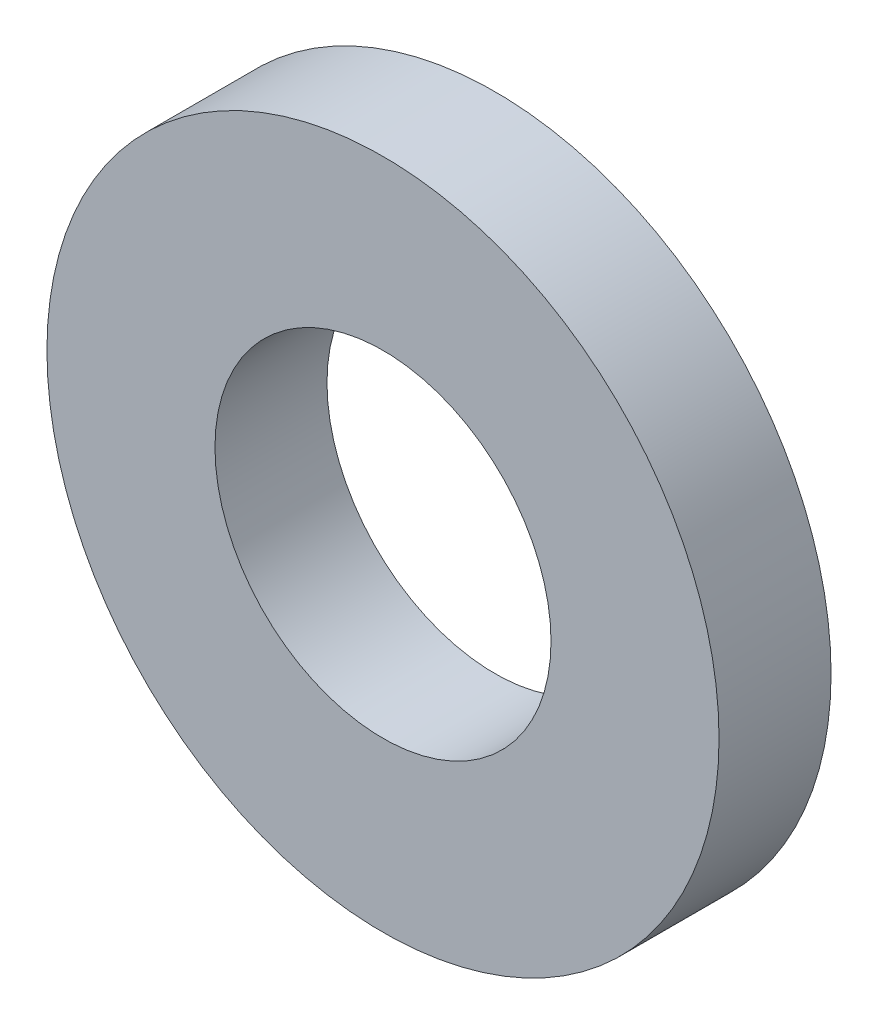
ISO-10303-21;
HEADER;
FILE_DESCRIPTION(('STEP AP214'),'2;1');
FILE_NAME('part.step','',(''),(''),'','','');
FILE_SCHEMA(('AUTOMOTIVE_DESIGN { 1 0 10303 214 1 1 1 1 }'));
ENDSEC;
DATA;
#1=APPLICATION_CONTEXT('core data for automotive mechanical design processes');
#2=APPLICATION_PROTOCOL_DEFINITION('international standard','automotive_design',2000,#1);
#3=PRODUCT_CONTEXT('',#1,'mechanical');
#4=PRODUCT('Part','Part','',(#3));
#5=PRODUCT_RELATED_PRODUCT_CATEGORY('part','',(#4));
#6=PRODUCT_DEFINITION_FORMATION('','',#4);
#7=PRODUCT_DEFINITION_CONTEXT('part definition',#1,'design');
#8=PRODUCT_DEFINITION('design','',#6,#7);
#9=PRODUCT_DEFINITION_SHAPE('','',#8);
#10=(LENGTH_UNIT() NAMED_UNIT(*) SI_UNIT(.MILLI.,.METRE.));
#11=(NAMED_UNIT(*) PLANE_ANGLE_UNIT() SI_UNIT($,.RADIAN.));
#12=(NAMED_UNIT(*) SI_UNIT($,.STERADIAN.) SOLID_ANGLE_UNIT());
#13=UNCERTAINTY_MEASURE_WITH_UNIT(LENGTH_MEASURE(1.E-05),#10,'distance_accuracy_value','');
#14=(GEOMETRIC_REPRESENTATION_CONTEXT(3) GLOBAL_UNCERTAINTY_ASSIGNED_CONTEXT((#13)) GLOBAL_UNIT_ASSIGNED_CONTEXT((#10,
#11,#12)) REPRESENTATION_CONTEXT('',''));
#15=CARTESIAN_POINT('',(0.,0.,0.));
#16=DIRECTION('',(0.,0.,1.));
#17=DIRECTION('',(1.,0.,0.));
#18=AXIS2_PLACEMENT_3D('',#15,#16,#17);
#19=CARTESIAN_POINT('',(0.,0.,-5.));
#20=DIRECTION('',(0.,0.,1.));
#21=DIRECTION('',(1.,0.,0.));
#22=AXIS2_PLACEMENT_3D('',#19,#20,#21);
#23=CYLINDRICAL_SURFACE('',#22,15.);
#24=CARTESIAN_POINT('',(0.,0.,-5.));
#25=DIRECTION('',(0.,0.,1.));
#26=DIRECTION('',(1.,0.,0.));
#27=AXIS2_PLACEMENT_3D('',#24,#25,#26);
#28=CIRCLE('',#27,15.);
#29=CARTESIAN_POINT('',(15.,0.,-5.));
#30=VERTEX_POINT('',#29);
#31=EDGE_CURVE('E10',#30,#30,#28,.T.);
#32=ORIENTED_EDGE('',*,*,#31,.T.);
#33=EDGE_LOOP('',(#32));
#34=FACE_BOUND('',#33,.T.);
#35=CARTESIAN_POINT('',(0.,0.,0.));
#36=DIRECTION('',(0.,0.,1.));
#37=DIRECTION('',(1.,0.,0.));
#38=AXIS2_PLACEMENT_3D('',#35,#36,#37);
#39=CIRCLE('',#38,15.);
#40=CARTESIAN_POINT('',(15.,0.,0.));
#41=VERTEX_POINT('',#40);
#42=EDGE_CURVE('E44',#41,#41,#39,.T.);
#43=ORIENTED_EDGE('',*,*,#42,.F.);
#44=EDGE_LOOP('',(#43));
#45=FACE_BOUND('',#44,.T.);
#46=ADVANCED_FACE('F41',(#34,#45),#23,.T.);
#47=CARTESIAN_POINT('',(0.,0.,-5.));
#48=DIRECTION('',(0.,0.,1.));
#49=DIRECTION('',(1.,0.,0.));
#50=AXIS2_PLACEMENT_3D('',#47,#48,#49);
#51=PLANE('',#50);
#52=CARTESIAN_POINT('',(0.,0.,-5.));
#53=DIRECTION('',(0.,0.,1.));
#54=DIRECTION('',(1.,0.,0.));
#55=AXIS2_PLACEMENT_3D('',#52,#53,#54);
#56=CIRCLE('',#55,7.5);
#57=CARTESIAN_POINT('',(7.5,0.,-5.));
#58=VERTEX_POINT('',#57);
#59=EDGE_CURVE('E54',#58,#58,#56,.T.);
#60=ORIENTED_EDGE('',*,*,#59,.T.);
#61=EDGE_LOOP('',(#60));
#62=FACE_BOUND('',#61,.T.);
#63=ORIENTED_EDGE('',*,*,#31,.F.);
#64=EDGE_LOOP('',(#63));
#65=FACE_BOUND('',#64,.T.);
#66=ADVANCED_FACE('F65',(#62,#65),#51,.F.);
#67=CARTESIAN_POINT('',(0.,0.,0.));
#68=DIRECTION('',(0.,0.,1.));
#69=DIRECTION('',(1.,0.,0.));
#70=AXIS2_PLACEMENT_3D('',#67,#68,#69);
#71=PLANE('',#70);
#72=CARTESIAN_POINT('',(0.,0.,0.));
#73=DIRECTION('',(0.,0.,1.));
#74=DIRECTION('',(1.,0.,0.));
#75=AXIS2_PLACEMENT_3D('',#72,#73,#74);
#76=CIRCLE('',#75,7.5);
#77=CARTESIAN_POINT('',(7.5,0.,0.));
#78=VERTEX_POINT('',#77);
#79=EDGE_CURVE('E56',#78,#78,#76,.T.);
#80=ORIENTED_EDGE('',*,*,#79,.F.);
#81=EDGE_LOOP('',(#80));
#82=FACE_BOUND('',#81,.T.);
#83=ORIENTED_EDGE('',*,*,#42,.T.);
#84=EDGE_LOOP('',(#83));
#85=FACE_BOUND('',#84,.T.);
#86=ADVANCED_FACE('F71',(#82,#85),#71,.T.);
#87=CARTESIAN_POINT('',(0.,0.,-5.));
#88=DIRECTION('',(0.,0.,1.));
#89=DIRECTION('',(1.,0.,0.));
#90=AXIS2_PLACEMENT_3D('',#87,#88,#89);
#91=CYLINDRICAL_SURFACE('',#90,7.5);
#92=ORIENTED_EDGE('',*,*,#59,.F.);
#93=EDGE_LOOP('',(#92));
#94=FACE_BOUND('',#93,.T.);
#95=ORIENTED_EDGE('',*,*,#79,.T.);
#96=EDGE_LOOP('',(#95));
#97=FACE_BOUND('',#96,.T.);
#98=ADVANCED_FACE('F68',(#94,#97),#91,.F.);
#99=CLOSED_SHELL('',(#46,#66,#86,#98));
#100=MANIFOLD_SOLID_BREP('B2',#99);
#101=ADVANCED_BREP_SHAPE_REPRESENTATION('',(#18,#100),#14);
#102=SHAPE_DEFINITION_REPRESENTATION(#9,#101);
ENDSEC;
END-ISO-10303-21;
